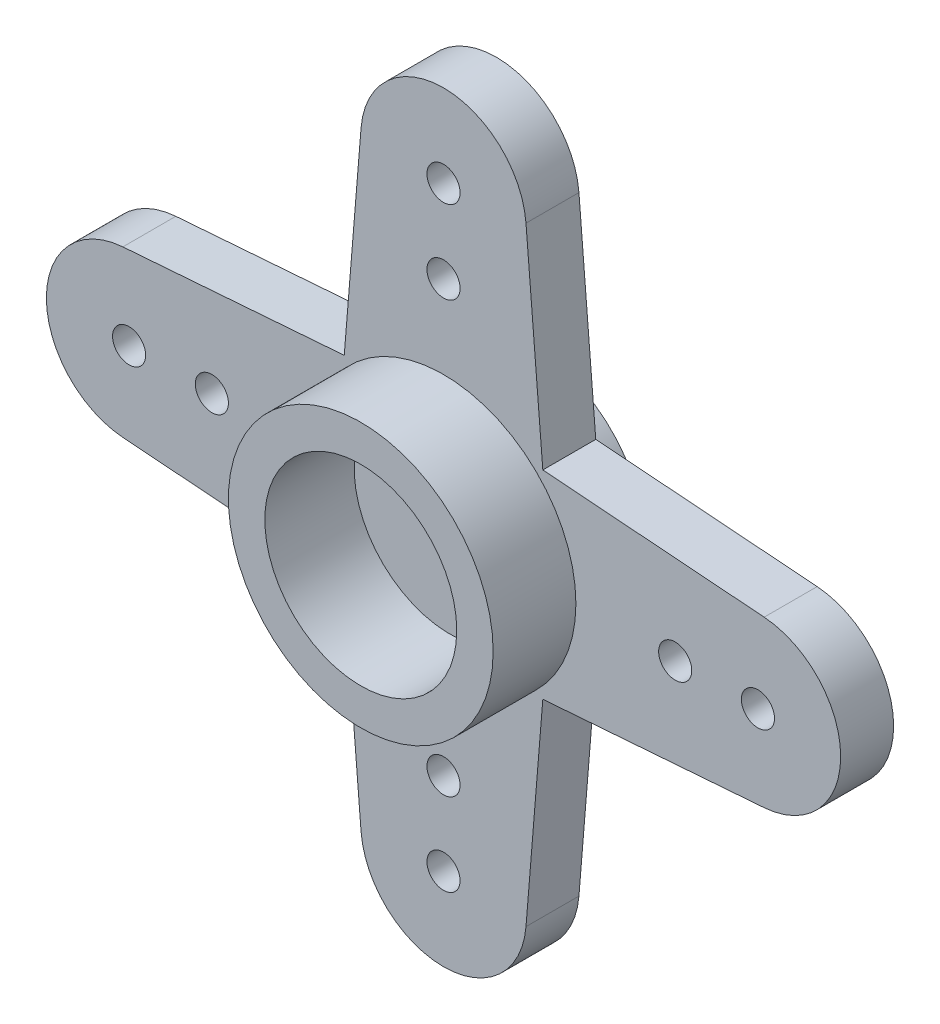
from build123d import *

# Parameters (mm, degrees)
ESQUISSE1_R      = 0.5
EXTRUSION1_DEPTH = 1.6
ESQUISSE2_R      = 3.5
EXTRUSION2_DEPTH = 1
ESQUISSE3_R      = 4
EXTRUSION3_DEPTH = 2.5
ESQUISSE4_R      = 2.9
EXTRUSION4_DEPTH = 2.7


with BuildPart() as part:
    # Esquisse1 → Extrusion1 (new body)
    with BuildSketch(Plane.XY):
        with BuildLine():
            Line((-9.689005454, 2.492845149), (-3, 3))
            Line((-3, 3), (-2.491649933, 9.2041583))
            ThreePointArc((-2.491649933, 9.2041583), (0, 11.5), (2.491649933, 9.2041583))
            Line((2.491649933, 9.2041583), (3, 3))
            Line((3, 3), (9.689005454, 2.492845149))
            ThreePointArc((9.689005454, 2.492845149), (12, 0), (9.689005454, -2.492845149))
            Line((9.689005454, -2.492845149), (3, -3))
            Line((3, -3), (2.491649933, -9.2041583))
            ThreePointArc((2.491649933, -9.2041583), (0, -11.5), (-2.491649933, -9.2041583))
            Line((-2.491649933, -9.2041583), (-3, -3))
            Line((-3, -3), (-9.689005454, -2.492845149))
            ThreePointArc((-9.689005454, -2.492845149), (-12, 0), (-9.689005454, 2.492845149))
        make_face()
        with Locations((0, 9)):
            Circle(ESQUISSE1_R, mode=Mode.SUBTRACT)
        with Locations((0, 6.5)):
            Circle(ESQUISSE1_R, mode=Mode.SUBTRACT)
        with Locations((-9.5, 0)):
            Circle(ESQUISSE1_R, mode=Mode.SUBTRACT)
        with Locations((-7, 0)):
            Circle(ESQUISSE1_R, mode=Mode.SUBTRACT)
        with Locations((7, 0)):
            Circle(ESQUISSE1_R, mode=Mode.SUBTRACT)
        with Locations((9.5, 0)):
            Circle(ESQUISSE1_R, mode=Mode.SUBTRACT)
        with Locations((0, -6.5)):
            Circle(ESQUISSE1_R, mode=Mode.SUBTRACT)
        with Locations((0, -9)):
            Circle(ESQUISSE1_R, mode=Mode.SUBTRACT)
    extrude(amount=EXTRUSION1_DEPTH)

    # Esquisse2 → Extrusion2 (add)
    with BuildSketch(Plane(origin=(0, 0, 0), x_dir=(-1, 0, 0), z_dir=(0, 0, -1))):
        with Locations(Location((0, 0, 0), (0, 0, 180))):
            Circle(ESQUISSE2_R)
    extrude(amount=EXTRUSION2_DEPTH)

    # Esquisse3 → Extrusion3 (add)
    with BuildSketch(Plane.XY.offset(1.6)):
        Circle(ESQUISSE3_R)
    extrude(amount=EXTRUSION3_DEPTH)

    # Esquisse4 → Extrusion4 (cut)
    with BuildSketch(Plane.XY.offset(4.1)):
        Circle(ESQUISSE4_R)
    extrude(amount=-EXTRUSION4_DEPTH, mode=Mode.SUBTRACT)


solid = part.part
